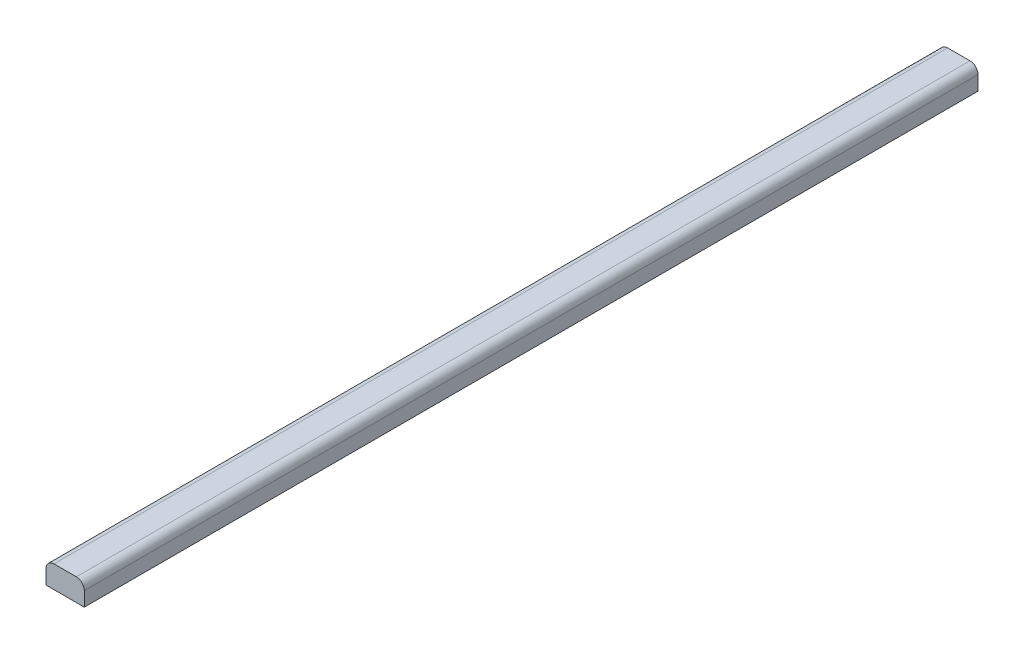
from build123d import *

# Parameters (mm, degrees)
BOSS_EXTRUDE1_DEPTH = 560


with BuildPart() as part:
    # Sketch3 → Boss-Extrude1 (new body)
    with BuildSketch(Plane.XY):
        with BuildLine():
            Line((-2816.802648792, 92.000070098), (-2816.802648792, 83.000070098))
            Line((-2816.802648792, 83.000070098), (-2840.802648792, 83.000070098))
            Line((-2840.802648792, 83.000070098), (-2840.802648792, 92.000070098))
            ThreePointArc((-2840.802648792, 92.000070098), (-2839.338182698, 95.535604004), (-2835.802648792, 97.000070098))
            Line((-2835.802648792, 97.000070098), (-2821.802648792, 97.000070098))
            ThreePointArc((-2821.802648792, 97.000070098), (-2818.267114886, 95.535604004), (-2816.802648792, 92.000070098))
        make_face()
    extrude(amount=BOSS_EXTRUDE1_DEPTH)


solid = part.part
